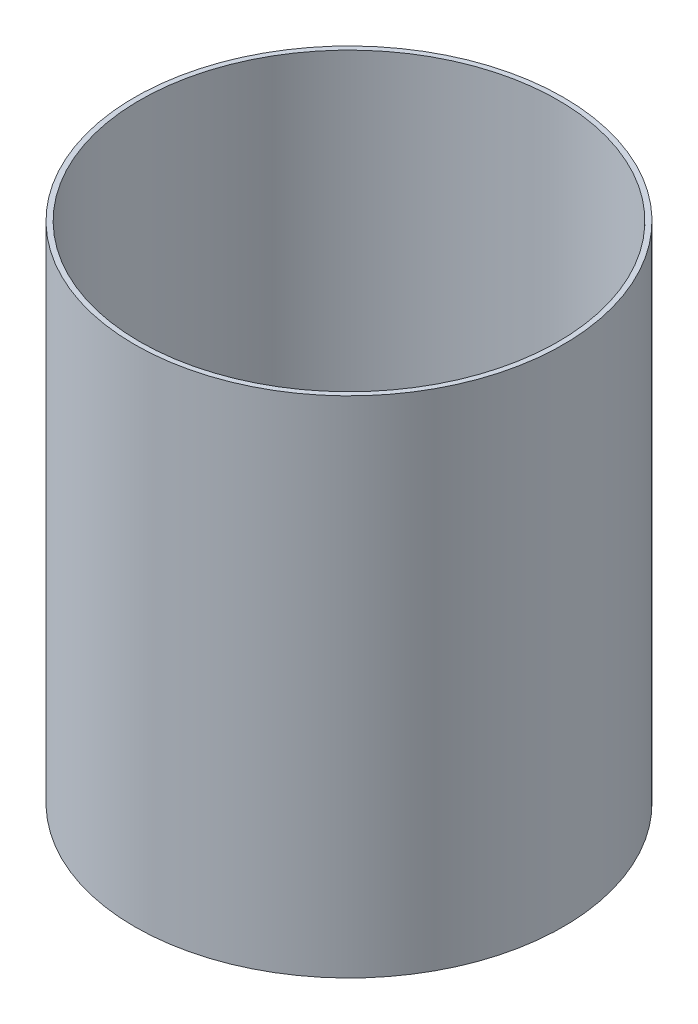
from build123d import *

# Parameters (mm, degrees)
SKETCH1_R           = 21.59
SKETCH1_R_2         = 21.082
BOSS_EXTRUDE1_DEPTH = 50.8


with BuildPart() as part:
    # Sketch1 → Boss-Extrude1 (new body)
    with BuildSketch(Plane(origin=(0, 0, 0), x_dir=(1, 0, 0), z_dir=(0, 1, 0))):
        with Locations(Location((0, 0, 0), (0, 0, 270))):
            Circle(SKETCH1_R)
        with Locations(Location((0, 0, 0), (0, 0, 270))):
            Circle(SKETCH1_R_2, mode=Mode.SUBTRACT)
    extrude(amount=BOSS_EXTRUDE1_DEPTH)


solid = part.part
